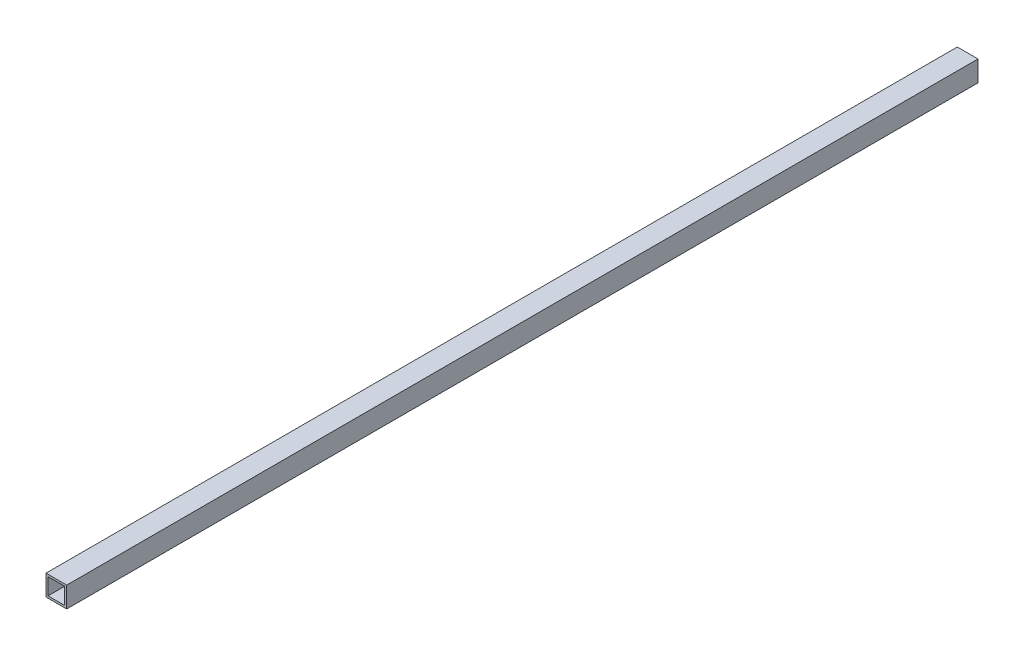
from build123d import *

# Parameters (mm, degrees)
ESQUISSE1_W        = 50
ESQUISSE1_H        = 50
ESQUISSE1_W_2      = 40
ESQUISSE1_H_2      = 40
BOSS_EXTRU_1_DEPTH = 2200


with BuildPart() as part:
    # Esquisse1 → Boss.-Extru.1 (new body)
    with BuildSketch(Plane.XY):
        with Locations((-25, 25)):
            Rectangle(ESQUISSE1_W, ESQUISSE1_H)
        with Locations((-25, 25)):
            Rectangle(ESQUISSE1_W_2, ESQUISSE1_H_2, mode=Mode.SUBTRACT)
    extrude(amount=BOSS_EXTRU_1_DEPTH)


solid = part.part
